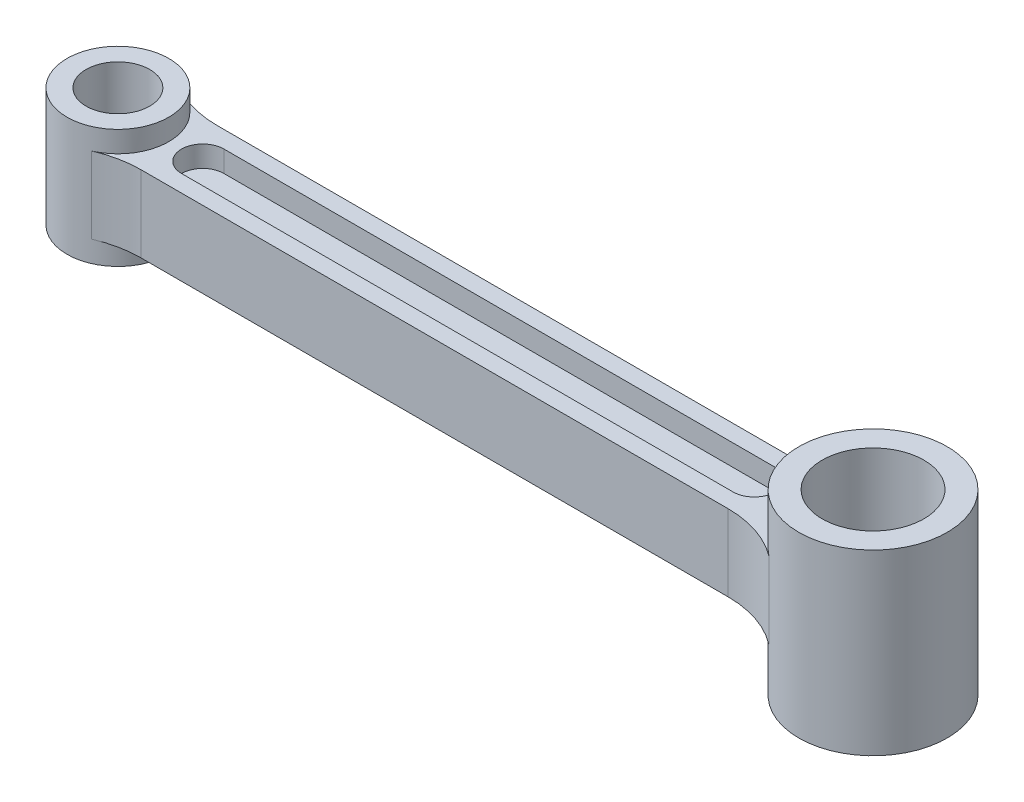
from build123d import *

# Parameters (mm, degrees)
SKETCH1_R           = 12
SKETCH1_R_2         = 7.5
BOSS_EXTRUDE1_DEPTH = 14
SKETCH1_3_R         = 17.5
SKETCH1_3_R_2       = 12
BOSS_EXTRUDE2_DEPTH = 21
BOSS_EXTRUDE3_DEPTH = 9
CUT_EXTRUDE1_DEPTH  = 5
FILLET1_R           = 24


with BuildPart() as part:
    # Sketch1 → Boss-Extrude1 (new, symmetric)
    with BuildSketch(Plane(origin=(0, 0, 0), x_dir=(1, 0, 0), z_dir=(0, 1, 0))):
        with Locations(Location((-178, 0, 0), (0, 0, 270))):
            Circle(SKETCH1_R)
        with Locations(Location((-178, 0, 0), (0, 0, 270))):
            Circle(SKETCH1_R_2, mode=Mode.SUBTRACT)
    extrude(amount=BOSS_EXTRUDE1_DEPTH, both=True)



with BuildPart() as body_2:
    # Sketch1_3 → Boss-Extrude2 (new, symmetric)
    with BuildSketch(Plane(origin=(0, 0, 0), x_dir=(1, 0, 0), z_dir=(0, 1, 0))):
        with Locations(Location((0, 0, 0), (0, 0, 90))):
            Circle(SKETCH1_3_R)
        with Locations(Location((0, 0, 0), (0, 0, 90))):
            Circle(SKETCH1_3_R_2, mode=Mode.SUBTRACT)
    extrude(amount=BOSS_EXTRUDE2_DEPTH, both=True)


with BuildPart() as part_1:
    add(part.part)

    add(body_2.part)  # Boss-Extrude3 merges body 2
    # Sketch1_4 → Boss-Extrude3 (add, symmetric)
    with BuildSketch(Plane(origin=(0, 0, 0), x_dir=(1, 0, 0), z_dir=(0, 1, 0))):
        with BuildLine():
            Line((-17.5, 0), (-166, 0))
            ThreePointArc((-166, 0), (-167.062746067, -4.937253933), (-170.062746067, -9))
            Line((-170.062746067, -9), (-15.00833102, -9))
            ThreePointArc((-15.00833102, -9), (-16.865583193, -4.669272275), (-17.5, 0))
        make_face()
        with BuildLine():
            ThreePointArc((-170.062746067, 9), (-167.062746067, 4.937253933), (-166, 0))
            Line((-166, 0), (-17.5, 0))
            ThreePointArc((-17.5, 0), (-16.865583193, 4.669272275), (-15.00833102, 9))
            Line((-15.00833102, 9), (-170.062746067, 9))
        make_face()
    extrude(amount=BOSS_EXTRUDE3_DEPTH, both=True)

    # Sketch2 → Cut-Extrude1 (cut)
    with BuildSketch(Plane(origin=(0, 9, 0), x_dir=(1, 0, 0), z_dir=(0, 1, 0))):
        with BuildLine():
            Line((-158, 5), (-28, 5))
            ThreePointArc((-28, 5), (-23, 0), (-28, -5))
            Line((-28, -5), (-158, -5))
            ThreePointArc((-158, -5), (-163, 0), (-158, 5))
        make_face()
    cut_extrude1 = extrude(amount=-CUT_EXTRUDE1_DEPTH, mode=Mode.SUBTRACT)

    # Mirror1: Cut-Extrude1 across plane
    add(cut_extrude1.mirror(Plane.ZX), mode=Mode.SUBTRACT)

    # Fillet1
    fillet1_edges = [part_1.edges().sort_by_distance(p)[0] for p in [
        (-15.00833102, 0, 9),
        (-15.00833102, 0, -9),
        (-170.062746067, 0, -9),
        (-170.062746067, 0, 9),
    ]]
    fillet(fillet1_edges, radius=FILLET1_R)


solid = part_1.part
